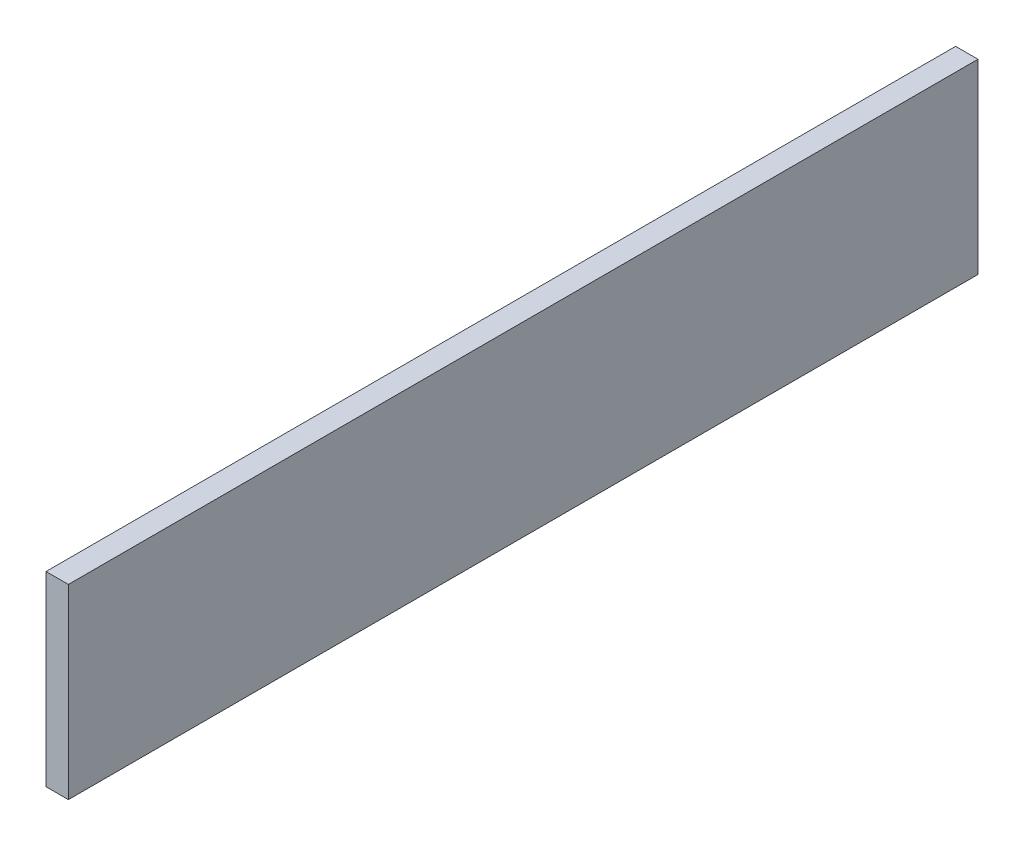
ISO-10303-21;
HEADER;
FILE_DESCRIPTION(('STEP AP214'),'2;1');
FILE_NAME('part.step','',(''),(''),'','','');
FILE_SCHEMA(('AUTOMOTIVE_DESIGN { 1 0 10303 214 1 1 1 1 }'));
ENDSEC;
DATA;
#1=APPLICATION_CONTEXT('core data for automotive mechanical design processes');
#2=APPLICATION_PROTOCOL_DEFINITION('international standard','automotive_design',2000,#1);
#3=PRODUCT_CONTEXT('',#1,'mechanical');
#4=PRODUCT('Part','Part','',(#3));
#5=PRODUCT_RELATED_PRODUCT_CATEGORY('part','',(#4));
#6=PRODUCT_DEFINITION_FORMATION('','',#4);
#7=PRODUCT_DEFINITION_CONTEXT('part definition',#1,'design');
#8=PRODUCT_DEFINITION('design','',#6,#7);
#9=PRODUCT_DEFINITION_SHAPE('','',#8);
#10=(LENGTH_UNIT() NAMED_UNIT(*) SI_UNIT(.MILLI.,.METRE.));
#11=(NAMED_UNIT(*) PLANE_ANGLE_UNIT() SI_UNIT($,.RADIAN.));
#12=(NAMED_UNIT(*) SI_UNIT($,.STERADIAN.) SOLID_ANGLE_UNIT());
#13=UNCERTAINTY_MEASURE_WITH_UNIT(LENGTH_MEASURE(1.E-05),#10,'distance_accuracy_value','');
#14=(GEOMETRIC_REPRESENTATION_CONTEXT(3) GLOBAL_UNCERTAINTY_ASSIGNED_CONTEXT((#13)) GLOBAL_UNIT_ASSIGNED_CONTEXT((#10,
#11,#12)) REPRESENTATION_CONTEXT('',''));
#15=CARTESIAN_POINT('',(0.,0.,0.));
#16=DIRECTION('',(0.,0.,1.));
#17=DIRECTION('',(1.,0.,0.));
#18=AXIS2_PLACEMENT_3D('',#15,#16,#17);
#19=CARTESIAN_POINT('',(3.048,0.,0.));
#20=DIRECTION('',(0.,0.,-1.));
#21=DIRECTION('',(-1.,0.,0.));
#22=AXIS2_PLACEMENT_3D('',#19,#20,#21);
#23=PLANE('',#22);
#24=DIRECTION('',(0.,-1.,0.));
#25=VECTOR('',#24,1.);
#26=CARTESIAN_POINT('',(0.,0.,0.));
#27=LINE('',#26,#25);
#28=CARTESIAN_POINT('',(0.,25.4,0.));
#29=VERTEX_POINT('',#28);
#30=CARTESIAN_POINT('',(0.,0.,0.));
#31=VERTEX_POINT('',#30);
#32=EDGE_CURVE('E96',#29,#31,#27,.T.);
#33=ORIENTED_EDGE('',*,*,#32,.T.);
#34=DIRECTION('',(-1.,0.,0.));
#35=VECTOR('',#34,1.);
#36=CARTESIAN_POINT('',(3.048,0.,0.));
#37=LINE('',#36,#35);
#38=CARTESIAN_POINT('',(3.048,0.,0.));
#39=VERTEX_POINT('',#38);
#40=EDGE_CURVE('E11',#39,#31,#37,.T.);
#41=ORIENTED_EDGE('',*,*,#40,.F.);
#42=DIRECTION('',(0.,-1.,0.));
#43=VECTOR('',#42,1.);
#44=CARTESIAN_POINT('',(3.048,0.,0.));
#45=LINE('',#44,#43);
#46=CARTESIAN_POINT('',(3.048,25.4,0.));
#47=VERTEX_POINT('',#46);
#48=EDGE_CURVE('E84',#47,#39,#45,.T.);
#49=ORIENTED_EDGE('',*,*,#48,.F.);
#50=DIRECTION('',(-1.,0.,0.));
#51=VECTOR('',#50,1.);
#52=CARTESIAN_POINT('',(3.048,25.4,0.));
#53=LINE('',#52,#51);
#54=EDGE_CURVE('E92',#47,#29,#53,.T.);
#55=ORIENTED_EDGE('',*,*,#54,.T.);
#56=EDGE_LOOP('',(#33,#41,#49,#55));
#57=FACE_BOUND('',#56,.T.);
#58=ADVANCED_FACE('F33',(#57),#23,.F.);
#59=CARTESIAN_POINT('',(3.048,0.,0.));
#60=DIRECTION('',(0.,1.,0.));
#61=DIRECTION('',(0.,0.,1.));
#62=AXIS2_PLACEMENT_3D('',#59,#60,#61);
#63=PLANE('',#62);
#64=DIRECTION('',(0.,0.,-1.));
#65=VECTOR('',#64,1.);
#66=CARTESIAN_POINT('',(0.,0.,0.));
#67=LINE('',#66,#65);
#68=CARTESIAN_POINT('',(0.,0.,-123.952));
#69=VERTEX_POINT('',#68);
#70=EDGE_CURVE('E88',#31,#69,#67,.T.);
#71=ORIENTED_EDGE('',*,*,#70,.T.);
#72=DIRECTION('',(-1.,0.,0.));
#73=VECTOR('',#72,1.);
#74=CARTESIAN_POINT('',(3.048,0.,-123.952));
#75=LINE('',#74,#73);
#76=CARTESIAN_POINT('',(3.048,0.,-123.952));
#77=VERTEX_POINT('',#76);
#78=EDGE_CURVE('E41',#77,#69,#75,.T.);
#79=ORIENTED_EDGE('',*,*,#78,.F.);
#80=DIRECTION('',(0.,0.,-1.));
#81=VECTOR('',#80,1.);
#82=CARTESIAN_POINT('',(3.048,0.,0.));
#83=LINE('',#82,#81);
#84=EDGE_CURVE('E79',#39,#77,#83,.T.);
#85=ORIENTED_EDGE('',*,*,#84,.F.);
#86=ORIENTED_EDGE('',*,*,#40,.T.);
#87=EDGE_LOOP('',(#71,#79,#85,#86));
#88=FACE_BOUND('',#87,.T.);
#89=ADVANCED_FACE('F87',(#88),#63,.F.);
#90=CARTESIAN_POINT('',(3.048,0.,-123.952));
#91=DIRECTION('',(0.,0.,1.));
#92=DIRECTION('',(1.,0.,0.));
#93=AXIS2_PLACEMENT_3D('',#90,#91,#92);
#94=PLANE('',#93);
#95=DIRECTION('',(0.,1.,0.));
#96=VECTOR('',#95,1.);
#97=CARTESIAN_POINT('',(0.,0.,-123.952));
#98=LINE('',#97,#96);
#99=CARTESIAN_POINT('',(0.,25.4,-123.952));
#100=VERTEX_POINT('',#99);
#101=EDGE_CURVE('E66',#69,#100,#98,.T.);
#102=ORIENTED_EDGE('',*,*,#101,.T.);
#103=DIRECTION('',(-1.,0.,0.));
#104=VECTOR('',#103,1.);
#105=CARTESIAN_POINT('',(3.048,25.4,-123.952));
#106=LINE('',#105,#104);
#107=CARTESIAN_POINT('',(3.048,25.4,-123.952));
#108=VERTEX_POINT('',#107);
#109=EDGE_CURVE('E89',#108,#100,#106,.T.);
#110=ORIENTED_EDGE('',*,*,#109,.F.);
#111=DIRECTION('',(0.,1.,0.));
#112=VECTOR('',#111,1.);
#113=CARTESIAN_POINT('',(3.048,0.,-123.952));
#114=LINE('',#113,#112);
#115=EDGE_CURVE('E82',#77,#108,#114,.T.);
#116=ORIENTED_EDGE('',*,*,#115,.F.);
#117=ORIENTED_EDGE('',*,*,#78,.T.);
#118=EDGE_LOOP('',(#102,#110,#116,#117));
#119=FACE_BOUND('',#118,.T.);
#120=ADVANCED_FACE('F90',(#119),#94,.F.);
#121=CARTESIAN_POINT('',(3.048,25.4,0.));
#122=DIRECTION('',(0.,-1.,0.));
#123=DIRECTION('',(0.,0.,-1.));
#124=AXIS2_PLACEMENT_3D('',#121,#122,#123);
#125=PLANE('',#124);
#126=DIRECTION('',(0.,0.,1.));
#127=VECTOR('',#126,1.);
#128=CARTESIAN_POINT('',(0.,25.4,0.));
#129=LINE('',#128,#127);
#130=EDGE_CURVE('E72',#100,#29,#129,.T.);
#131=ORIENTED_EDGE('',*,*,#130,.T.);
#132=ORIENTED_EDGE('',*,*,#54,.F.);
#133=DIRECTION('',(0.,0.,1.));
#134=VECTOR('',#133,1.);
#135=CARTESIAN_POINT('',(3.048,25.4,0.));
#136=LINE('',#135,#134);
#137=EDGE_CURVE('E49',#108,#47,#136,.T.);
#138=ORIENTED_EDGE('',*,*,#137,.F.);
#139=ORIENTED_EDGE('',*,*,#109,.T.);
#140=EDGE_LOOP('',(#131,#132,#138,#139));
#141=FACE_BOUND('',#140,.T.);
#142=ADVANCED_FACE('F103',(#141),#125,.F.);
#143=CARTESIAN_POINT('',(3.048,0.,0.));
#144=DIRECTION('',(-1.,0.,0.));
#145=DIRECTION('',(0.,0.,1.));
#146=AXIS2_PLACEMENT_3D('',#143,#144,#145);
#147=PLANE('',#146);
#148=ORIENTED_EDGE('',*,*,#48,.T.);
#149=ORIENTED_EDGE('',*,*,#84,.T.);
#150=ORIENTED_EDGE('',*,*,#115,.T.);
#151=ORIENTED_EDGE('',*,*,#137,.T.);
#152=EDGE_LOOP('',(#148,#149,#150,#151));
#153=FACE_BOUND('',#152,.T.);
#154=ADVANCED_FACE('F80',(#153),#147,.F.);
#155=CARTESIAN_POINT('',(0.,0.,0.));
#156=DIRECTION('',(-1.,0.,0.));
#157=DIRECTION('',(0.,0.,1.));
#158=AXIS2_PLACEMENT_3D('',#155,#156,#157);
#159=PLANE('',#158);
#160=ORIENTED_EDGE('',*,*,#32,.F.);
#161=ORIENTED_EDGE('',*,*,#130,.F.);
#162=ORIENTED_EDGE('',*,*,#101,.F.);
#163=ORIENTED_EDGE('',*,*,#70,.F.);
#164=EDGE_LOOP('',(#160,#161,#162,#163));
#165=FACE_BOUND('',#164,.T.);
#166=ADVANCED_FACE('F106',(#165),#159,.T.);
#167=CLOSED_SHELL('',(#58,#89,#120,#142,#154,#166));
#168=MANIFOLD_SOLID_BREP('B2',#167);
#169=ADVANCED_BREP_SHAPE_REPRESENTATION('',(#18,#168),#14);
#170=SHAPE_DEFINITION_REPRESENTATION(#9,#169);
ENDSEC;
END-ISO-10303-21;
